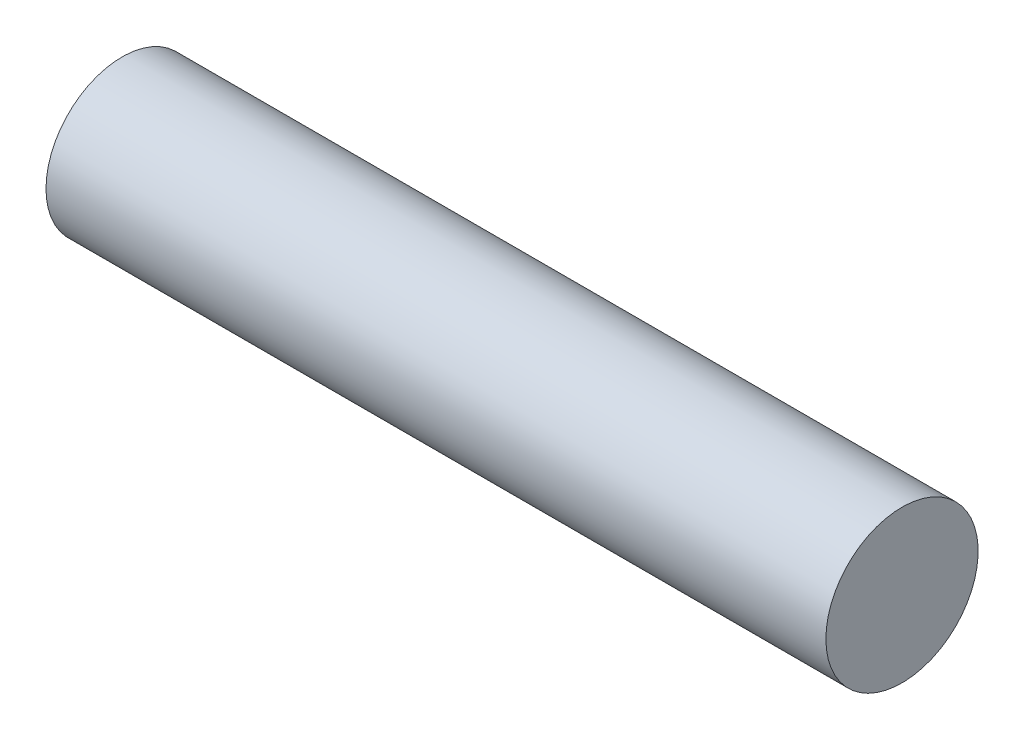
ISO-10303-21;
HEADER;
FILE_DESCRIPTION(('STEP AP214'),'2;1');
FILE_NAME('part.step','',(''),(''),'','','');
FILE_SCHEMA(('AUTOMOTIVE_DESIGN { 1 0 10303 214 1 1 1 1 }'));
ENDSEC;
DATA;
#1=APPLICATION_CONTEXT('core data for automotive mechanical design processes');
#2=APPLICATION_PROTOCOL_DEFINITION('international standard','automotive_design',2000,#1);
#3=PRODUCT_CONTEXT('',#1,'mechanical');
#4=PRODUCT('Part','Part','',(#3));
#5=PRODUCT_RELATED_PRODUCT_CATEGORY('part','',(#4));
#6=PRODUCT_DEFINITION_FORMATION('','',#4);
#7=PRODUCT_DEFINITION_CONTEXT('part definition',#1,'design');
#8=PRODUCT_DEFINITION('design','',#6,#7);
#9=PRODUCT_DEFINITION_SHAPE('','',#8);
#10=(LENGTH_UNIT() NAMED_UNIT(*) SI_UNIT(.MILLI.,.METRE.));
#11=(NAMED_UNIT(*) PLANE_ANGLE_UNIT() SI_UNIT($,.RADIAN.));
#12=(NAMED_UNIT(*) SI_UNIT($,.STERADIAN.) SOLID_ANGLE_UNIT());
#13=UNCERTAINTY_MEASURE_WITH_UNIT(LENGTH_MEASURE(1.E-05),#10,'distance_accuracy_value','');
#14=(GEOMETRIC_REPRESENTATION_CONTEXT(3) GLOBAL_UNCERTAINTY_ASSIGNED_CONTEXT((#13)) GLOBAL_UNIT_ASSIGNED_CONTEXT((#10,
#11,#12)) REPRESENTATION_CONTEXT('',''));
#15=CARTESIAN_POINT('',(0.,0.,0.));
#16=DIRECTION('',(0.,0.,1.));
#17=DIRECTION('',(1.,0.,0.));
#18=AXIS2_PLACEMENT_3D('',#15,#16,#17);
#19=CARTESIAN_POINT('',(21.,0.,0.));
#20=DIRECTION('',(-1.,0.,0.));
#21=DIRECTION('',(0.,0.,1.));
#22=AXIS2_PLACEMENT_3D('',#19,#20,#21);
#23=CYLINDRICAL_SURFACE('',#22,2.05);
#24=CARTESIAN_POINT('',(21.,0.,0.));
#25=DIRECTION('',(1.,0.,0.));
#26=DIRECTION('',(0.,0.,-1.));
#27=AXIS2_PLACEMENT_3D('',#24,#25,#26);
#28=CIRCLE('',#27,2.05);
#29=CARTESIAN_POINT('',(21.,0.,2.05));
#30=VERTEX_POINT('',#29);
#31=EDGE_CURVE('E10',#30,#30,#28,.T.);
#32=CARTESIAN_POINT('',(0.,0.,0.));
#33=DIRECTION('',(1.,0.,0.));
#34=DIRECTION('',(0.,0.,-1.));
#35=AXIS2_PLACEMENT_3D('',#32,#33,#34);
#36=CIRCLE('',#35,2.05);
#37=CARTESIAN_POINT('',(0.,0.,2.05));
#38=VERTEX_POINT('',#37);
#39=EDGE_CURVE('E48',#38,#38,#36,.T.);
#40=CARTESIAN_POINT('',(21.,0.,2.05));
#41=CARTESIAN_POINT('',(20.78125,0.,2.05));
#42=CARTESIAN_POINT('',(20.5625,0.,2.05));
#43=CARTESIAN_POINT('',(20.125,0.,2.05));
#44=CARTESIAN_POINT('',(19.90625,0.,2.05));
#45=CARTESIAN_POINT('',(19.46875,0.,2.05));
#46=CARTESIAN_POINT('',(19.25,0.,2.05));
#47=CARTESIAN_POINT('',(18.8125,0.,2.05));
#48=CARTESIAN_POINT('',(18.59375,0.,2.05));
#49=CARTESIAN_POINT('',(18.15625,0.,2.05));
#50=CARTESIAN_POINT('',(17.9375,0.,2.05));
#51=CARTESIAN_POINT('',(17.5,0.,2.05));
#52=CARTESIAN_POINT('',(17.28125,0.,2.05));
#53=CARTESIAN_POINT('',(16.84375,0.,2.05));
#54=CARTESIAN_POINT('',(16.625,0.,2.05));
#55=CARTESIAN_POINT('',(16.1875,0.,2.05));
#56=CARTESIAN_POINT('',(15.96875,0.,2.05));
#57=CARTESIAN_POINT('',(15.53125,0.,2.05));
#58=CARTESIAN_POINT('',(15.3125,0.,2.05));
#59=CARTESIAN_POINT('',(14.875,0.,2.05));
#60=CARTESIAN_POINT('',(14.65625,0.,2.05));
#61=CARTESIAN_POINT('',(14.21875,0.,2.05));
#62=CARTESIAN_POINT('',(14.,0.,2.05));
#63=CARTESIAN_POINT('',(13.5625,0.,2.05));
#64=CARTESIAN_POINT('',(13.34375,0.,2.05));
#65=CARTESIAN_POINT('',(12.90625,0.,2.05));
#66=CARTESIAN_POINT('',(12.6875,0.,2.05));
#67=CARTESIAN_POINT('',(12.25,0.,2.05));
#68=CARTESIAN_POINT('',(12.03125,0.,2.05));
#69=CARTESIAN_POINT('',(11.59375,0.,2.05));
#70=CARTESIAN_POINT('',(11.375,0.,2.05));
#71=CARTESIAN_POINT('',(10.9375,0.,2.05));
#72=CARTESIAN_POINT('',(10.71875,0.,2.05));
#73=CARTESIAN_POINT('',(10.28125,0.,2.05));
#74=CARTESIAN_POINT('',(10.0625,0.,2.05));
#75=CARTESIAN_POINT('',(9.625,0.,2.05));
#76=CARTESIAN_POINT('',(9.40625,0.,2.05));
#77=CARTESIAN_POINT('',(8.96875,0.,2.05));
#78=CARTESIAN_POINT('',(8.75,0.,2.05));
#79=CARTESIAN_POINT('',(8.3125,0.,2.05));
#80=CARTESIAN_POINT('',(8.09375,0.,2.05));
#81=CARTESIAN_POINT('',(7.65625,0.,2.05));
#82=CARTESIAN_POINT('',(7.4375,0.,2.05));
#83=CARTESIAN_POINT('',(7.,0.,2.05));
#84=CARTESIAN_POINT('',(6.78125,0.,2.05));
#85=CARTESIAN_POINT('',(6.34375,0.,2.05));
#86=CARTESIAN_POINT('',(6.125,0.,2.05));
#87=CARTESIAN_POINT('',(5.6875,0.,2.05));
#88=CARTESIAN_POINT('',(5.46875,0.,2.05));
#89=CARTESIAN_POINT('',(5.03125,0.,2.05));
#90=CARTESIAN_POINT('',(4.8125,0.,2.05));
#91=CARTESIAN_POINT('',(4.375,0.,2.05));
#92=CARTESIAN_POINT('',(4.15625,0.,2.05));
#93=CARTESIAN_POINT('',(3.71875,0.,2.05));
#94=CARTESIAN_POINT('',(3.5,0.,2.05));
#95=CARTESIAN_POINT('',(3.0625,0.,2.05));
#96=CARTESIAN_POINT('',(2.84375,0.,2.05));
#97=CARTESIAN_POINT('',(2.40625,0.,2.05));
#98=CARTESIAN_POINT('',(2.1875,0.,2.05));
#99=CARTESIAN_POINT('',(1.75,0.,2.05));
#100=CARTESIAN_POINT('',(1.53125,0.,2.05));
#101=CARTESIAN_POINT('',(1.09375,0.,2.05));
#102=CARTESIAN_POINT('',(0.875000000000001,0.,2.05));
#103=CARTESIAN_POINT('',(0.4375,0.,2.05));
#104=CARTESIAN_POINT('',(0.21875,0.,2.05));
#105=CARTESIAN_POINT('',(0.,0.,2.05));
#106=B_SPLINE_CURVE_WITH_KNOTS('',3,(#40,#41,#42,#43,#44,#45,#46,#47,#48,#49,#50,#51,#52,#53,
#54,#55,#56,#57,#58,#59,#60,#61,#62,#63,#64,#65,#66,#67,#68,#69,#70,#71,#72,#73,#74,#75,#76,#77,
#78,#79,#80,#81,#82,#83,#84,#85,#86,#87,#88,#89,#90,#91,#92,#93,#94,#95,#96,#97,#98,#99,#100,
#101,#102,#103,#104,#105),.UNSPECIFIED.,.F.,.F.,(4,2,2,2,2,2,2,2,2,2,2,2,2,2,2,2,2,2,2,2,2,2,2,
2,2,2,2,2,2,2,2,2,4),(0.,0.656250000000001,1.3125,1.96875,2.625,3.28125,3.9375,4.59375,5.25,
5.90625,6.5625,7.21875,7.875,8.53125,9.1875,9.84375,10.5,11.15625,11.8125,12.46875,13.125,
13.78125,14.4375,15.09375,15.75,16.40625,17.0625,17.71875,18.375,19.03125,19.6875,20.34375,21.),.UNSPECIFIED.);
#107=EDGE_CURVE('BSEAM45',#30,#38,#106,.T.);
#108=ORIENTED_EDGE('',*,*,#31,.F.);
#109=ORIENTED_EDGE('',*,*,#39,.T.);
#110=ORIENTED_EDGE('',*,*,#107,.T.);
#111=ORIENTED_EDGE('',*,*,#107,.F.);
#112=EDGE_LOOP('',(#108,#110,#109,#111));
#113=FACE_BOUND('',#112,.T.);
#114=ADVANCED_FACE('F45',(#113),#23,.T.);
#115=CARTESIAN_POINT('',(21.,0.,0.));
#116=DIRECTION('',(1.,0.,0.));
#117=DIRECTION('',(0.,0.,-1.));
#118=AXIS2_PLACEMENT_3D('',#115,#116,#117);
#119=PLANE('',#118);
#120=ORIENTED_EDGE('',*,*,#31,.T.);
#121=EDGE_LOOP('',(#120));
#122=FACE_BOUND('',#121,.T.);
#123=ADVANCED_FACE('F64',(#122),#119,.T.);
#124=CARTESIAN_POINT('',(0.,0.,0.));
#125=DIRECTION('',(1.,0.,0.));
#126=DIRECTION('',(0.,0.,-1.));
#127=AXIS2_PLACEMENT_3D('',#124,#125,#126);
#128=PLANE('',#127);
#129=ORIENTED_EDGE('',*,*,#39,.F.);
#130=EDGE_LOOP('',(#129));
#131=FACE_BOUND('',#130,.T.);
#132=ADVANCED_FACE('F62',(#131),#128,.F.);
#133=CLOSED_SHELL('',(#114,#123,#132));
#134=MANIFOLD_SOLID_BREP('B2',#133);
#135=ADVANCED_BREP_SHAPE_REPRESENTATION('',(#18,#134),#14);
#136=SHAPE_DEFINITION_REPRESENTATION(#9,#135);
ENDSEC;
END-ISO-10303-21;
